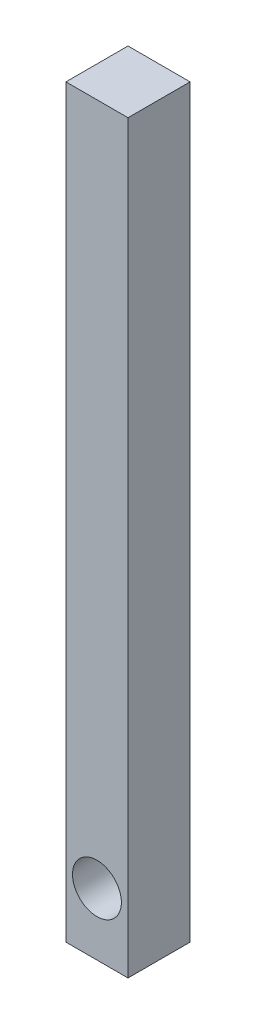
ISO-10303-21;
HEADER;
FILE_DESCRIPTION(('STEP AP214'),'2;1');
FILE_NAME('part.step','',(''),(''),'','','');
FILE_SCHEMA(('AUTOMOTIVE_DESIGN { 1 0 10303 214 1 1 1 1 }'));
ENDSEC;
DATA;
#1=APPLICATION_CONTEXT('core data for automotive mechanical design processes');
#2=APPLICATION_PROTOCOL_DEFINITION('international standard','automotive_design',2000,#1);
#3=PRODUCT_CONTEXT('',#1,'mechanical');
#4=PRODUCT('Part','Part','',(#3));
#5=PRODUCT_RELATED_PRODUCT_CATEGORY('part','',(#4));
#6=PRODUCT_DEFINITION_FORMATION('','',#4);
#7=PRODUCT_DEFINITION_CONTEXT('part definition',#1,'design');
#8=PRODUCT_DEFINITION('design','',#6,#7);
#9=PRODUCT_DEFINITION_SHAPE('','',#8);
#10=(LENGTH_UNIT() NAMED_UNIT(*) SI_UNIT(.MILLI.,.METRE.));
#11=(NAMED_UNIT(*) PLANE_ANGLE_UNIT() SI_UNIT($,.RADIAN.));
#12=(NAMED_UNIT(*) SI_UNIT($,.STERADIAN.) SOLID_ANGLE_UNIT());
#13=UNCERTAINTY_MEASURE_WITH_UNIT(LENGTH_MEASURE(1.E-05),#10,'distance_accuracy_value','');
#14=(GEOMETRIC_REPRESENTATION_CONTEXT(3) GLOBAL_UNCERTAINTY_ASSIGNED_CONTEXT((#13)) GLOBAL_UNIT_ASSIGNED_CONTEXT((#10,
#11,#12)) REPRESENTATION_CONTEXT('',''));
#15=CARTESIAN_POINT('',(0.,0.,0.));
#16=DIRECTION('',(0.,0.,1.));
#17=DIRECTION('',(1.,0.,0.));
#18=AXIS2_PLACEMENT_3D('',#15,#16,#17);
#19=CARTESIAN_POINT('',(0.,0.,6.35));
#20=DIRECTION('',(-1.,0.,0.));
#21=DIRECTION('',(0.,0.,1.));
#22=AXIS2_PLACEMENT_3D('',#19,#20,#21);
#23=PLANE('',#22);
#24=DIRECTION('',(0.,1.,0.));
#25=VECTOR('',#24,1.);
#26=CARTESIAN_POINT('',(0.,0.,0.));
#27=LINE('',#26,#25);
#28=CARTESIAN_POINT('',(0.,0.,0.));
#29=VERTEX_POINT('',#28);
#30=CARTESIAN_POINT('',(0.,76.2,0.));
#31=VERTEX_POINT('',#30);
#32=EDGE_CURVE('E97',#29,#31,#27,.T.);
#33=ORIENTED_EDGE('',*,*,#32,.T.);
#34=DIRECTION('',(0.,0.,-1.));
#35=VECTOR('',#34,1.);
#36=CARTESIAN_POINT('',(0.,76.2,6.35));
#37=LINE('',#36,#35);
#38=CARTESIAN_POINT('',(0.,76.2,6.35));
#39=VERTEX_POINT('',#38);
#40=EDGE_CURVE('E11',#39,#31,#37,.T.);
#41=ORIENTED_EDGE('',*,*,#40,.F.);
#42=DIRECTION('',(0.,1.,0.));
#43=VECTOR('',#42,1.);
#44=CARTESIAN_POINT('',(0.,0.,6.35));
#45=LINE('',#44,#43);
#46=CARTESIAN_POINT('',(0.,0.,6.35));
#47=VERTEX_POINT('',#46);
#48=EDGE_CURVE('E85',#47,#39,#45,.T.);
#49=ORIENTED_EDGE('',*,*,#48,.F.);
#50=DIRECTION('',(0.,0.,-1.));
#51=VECTOR('',#50,1.);
#52=CARTESIAN_POINT('',(0.,0.,6.35));
#53=LINE('',#52,#51);
#54=EDGE_CURVE('E93',#47,#29,#53,.T.);
#55=ORIENTED_EDGE('',*,*,#54,.T.);
#56=EDGE_LOOP('',(#33,#41,#49,#55));
#57=FACE_BOUND('',#56,.T.);
#58=ADVANCED_FACE('F34',(#57),#23,.F.);
#59=CARTESIAN_POINT('',(0.,76.2,6.35));
#60=DIRECTION('',(0.,-1.,0.));
#61=DIRECTION('',(0.,0.,-1.));
#62=AXIS2_PLACEMENT_3D('',#59,#60,#61);
#63=PLANE('',#62);
#64=DIRECTION('',(-1.,0.,0.));
#65=VECTOR('',#64,1.);
#66=CARTESIAN_POINT('',(0.,76.2,0.));
#67=LINE('',#66,#65);
#68=CARTESIAN_POINT('',(-6.35,76.2,0.));
#69=VERTEX_POINT('',#68);
#70=EDGE_CURVE('E89',#31,#69,#67,.T.);
#71=ORIENTED_EDGE('',*,*,#70,.T.);
#72=DIRECTION('',(0.,0.,-1.));
#73=VECTOR('',#72,1.);
#74=CARTESIAN_POINT('',(-6.35,76.2,6.35));
#75=LINE('',#74,#73);
#76=CARTESIAN_POINT('',(-6.35,76.2,6.35));
#77=VERTEX_POINT('',#76);
#78=EDGE_CURVE('E42',#77,#69,#75,.T.);
#79=ORIENTED_EDGE('',*,*,#78,.F.);
#80=DIRECTION('',(-1.,0.,0.));
#81=VECTOR('',#80,1.);
#82=CARTESIAN_POINT('',(0.,76.2,6.35));
#83=LINE('',#82,#81);
#84=EDGE_CURVE('E80',#39,#77,#83,.T.);
#85=ORIENTED_EDGE('',*,*,#84,.F.);
#86=ORIENTED_EDGE('',*,*,#40,.T.);
#87=EDGE_LOOP('',(#71,#79,#85,#86));
#88=FACE_BOUND('',#87,.T.);
#89=ADVANCED_FACE('F88',(#88),#63,.F.);
#90=CARTESIAN_POINT('',(-6.35,0.,6.35));
#91=DIRECTION('',(1.,0.,0.));
#92=DIRECTION('',(0.,1.,0.));
#93=AXIS2_PLACEMENT_3D('',#90,#91,#92);
#94=PLANE('',#93);
#95=DIRECTION('',(0.,-1.,0.));
#96=VECTOR('',#95,1.);
#97=CARTESIAN_POINT('',(-6.35,0.,0.));
#98=LINE('',#97,#96);
#99=CARTESIAN_POINT('',(-6.35,0.,0.));
#100=VERTEX_POINT('',#99);
#101=EDGE_CURVE('E67',#69,#100,#98,.T.);
#102=ORIENTED_EDGE('',*,*,#101,.T.);
#103=DIRECTION('',(0.,0.,-1.));
#104=VECTOR('',#103,1.);
#105=CARTESIAN_POINT('',(-6.35,0.,6.35));
#106=LINE('',#105,#104);
#107=CARTESIAN_POINT('',(-6.35,0.,6.35));
#108=VERTEX_POINT('',#107);
#109=EDGE_CURVE('E90',#108,#100,#106,.T.);
#110=ORIENTED_EDGE('',*,*,#109,.F.);
#111=DIRECTION('',(0.,-1.,0.));
#112=VECTOR('',#111,1.);
#113=CARTESIAN_POINT('',(-6.35,0.,6.35));
#114=LINE('',#113,#112);
#115=EDGE_CURVE('E83',#77,#108,#114,.T.);
#116=ORIENTED_EDGE('',*,*,#115,.F.);
#117=ORIENTED_EDGE('',*,*,#78,.T.);
#118=EDGE_LOOP('',(#102,#110,#116,#117));
#119=FACE_BOUND('',#118,.T.);
#120=ADVANCED_FACE('F91',(#119),#94,.F.);
#121=CARTESIAN_POINT('',(0.,0.,6.35));
#122=DIRECTION('',(0.,1.,0.));
#123=DIRECTION('',(-1.,0.,0.));
#124=AXIS2_PLACEMENT_3D('',#121,#122,#123);
#125=PLANE('',#124);
#126=DIRECTION('',(1.,0.,0.));
#127=VECTOR('',#126,1.);
#128=CARTESIAN_POINT('',(0.,0.,0.));
#129=LINE('',#128,#127);
#130=EDGE_CURVE('E73',#100,#29,#129,.T.);
#131=ORIENTED_EDGE('',*,*,#130,.T.);
#132=ORIENTED_EDGE('',*,*,#54,.F.);
#133=DIRECTION('',(1.,0.,0.));
#134=VECTOR('',#133,1.);
#135=CARTESIAN_POINT('',(0.,0.,6.35));
#136=LINE('',#135,#134);
#137=EDGE_CURVE('E50',#108,#47,#136,.T.);
#138=ORIENTED_EDGE('',*,*,#137,.F.);
#139=ORIENTED_EDGE('',*,*,#109,.T.);
#140=EDGE_LOOP('',(#131,#132,#138,#139));
#141=FACE_BOUND('',#140,.T.);
#142=ADVANCED_FACE('F105',(#141),#125,.F.);
#143=CARTESIAN_POINT('',(0.,0.,6.35));
#144=DIRECTION('',(0.,0.,1.));
#145=DIRECTION('',(1.,0.,0.));
#146=AXIS2_PLACEMENT_3D('',#143,#144,#145);
#147=PLANE('',#146);
#148=CARTESIAN_POINT('',(-3.175,6.35,6.35));
#149=DIRECTION('',(0.,0.,1.));
#150=DIRECTION('',(1.,0.,0.));
#151=AXIS2_PLACEMENT_3D('',#148,#149,#150);
#152=CIRCLE('',#151,2.5);
#153=CARTESIAN_POINT('',(-0.674999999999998,6.35,6.35));
#154=VERTEX_POINT('',#153);
#155=EDGE_CURVE('E111',#154,#154,#152,.T.);
#156=ORIENTED_EDGE('',*,*,#155,.F.);
#157=EDGE_LOOP('',(#156));
#158=FACE_BOUND('',#157,.T.);
#159=ORIENTED_EDGE('',*,*,#48,.T.);
#160=ORIENTED_EDGE('',*,*,#84,.T.);
#161=ORIENTED_EDGE('',*,*,#115,.T.);
#162=ORIENTED_EDGE('',*,*,#137,.T.);
#163=EDGE_LOOP('',(#159,#160,#161,#162));
#164=FACE_BOUND('',#163,.T.);
#165=ADVANCED_FACE('F81',(#158,#164),#147,.T.);
#166=CARTESIAN_POINT('',(0.,0.,0.));
#167=DIRECTION('',(0.,0.,1.));
#168=DIRECTION('',(1.,0.,0.));
#169=AXIS2_PLACEMENT_3D('',#166,#167,#168);
#170=PLANE('',#169);
#171=CARTESIAN_POINT('',(-3.175,6.35,0.));
#172=DIRECTION('',(0.,0.,1.));
#173=DIRECTION('',(1.,0.,0.));
#174=AXIS2_PLACEMENT_3D('',#171,#172,#173);
#175=CIRCLE('',#174,2.5);
#176=CARTESIAN_POINT('',(-0.674999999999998,6.35,0.));
#177=VERTEX_POINT('',#176);
#178=EDGE_CURVE('E100',#177,#177,#175,.T.);
#179=ORIENTED_EDGE('',*,*,#178,.T.);
#180=EDGE_LOOP('',(#179));
#181=FACE_BOUND('',#180,.T.);
#182=ORIENTED_EDGE('',*,*,#32,.F.);
#183=ORIENTED_EDGE('',*,*,#130,.F.);
#184=ORIENTED_EDGE('',*,*,#101,.F.);
#185=ORIENTED_EDGE('',*,*,#70,.F.);
#186=EDGE_LOOP('',(#182,#183,#184,#185));
#187=FACE_BOUND('',#186,.T.);
#188=ADVANCED_FACE('F108',(#181,#187),#170,.F.);
#189=CARTESIAN_POINT('',(-3.175,6.35,0.));
#190=DIRECTION('',(0.,0.,1.));
#191=DIRECTION('',(1.,0.,0.));
#192=AXIS2_PLACEMENT_3D('',#189,#190,#191);
#193=CYLINDRICAL_SURFACE('',#192,2.5);
#194=ORIENTED_EDGE('',*,*,#178,.F.);
#195=EDGE_LOOP('',(#194));
#196=FACE_BOUND('',#195,.T.);
#197=ORIENTED_EDGE('',*,*,#155,.T.);
#198=EDGE_LOOP('',(#197));
#199=FACE_BOUND('',#198,.T.);
#200=ADVANCED_FACE('F118',(#196,#199),#193,.F.);
#201=CLOSED_SHELL('',(#58,#89,#120,#142,#165,#188,#200));
#202=MANIFOLD_SOLID_BREP('B2',#201);
#203=ADVANCED_BREP_SHAPE_REPRESENTATION('',(#18,#202),#14);
#204=SHAPE_DEFINITION_REPRESENTATION(#9,#203);
ENDSEC;
END-ISO-10303-21;
